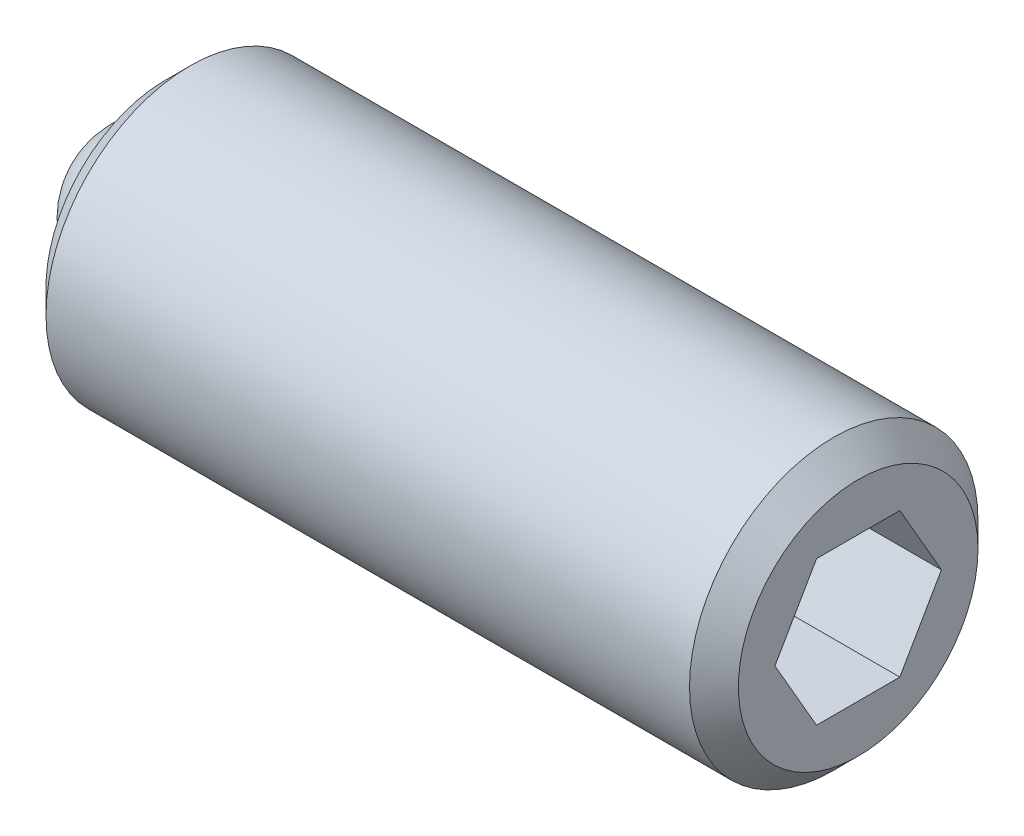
from build123d import *

# Parameters (mm, degrees)
SKETCH2_R           = 1.5
BOSS_EXTRUDE1_DEPTH = 7.2
CHAMFER1_SIZE       = 0.254
CHAMFER2_SIZE       = 0.254
CUT_EXTRUDE2_DEPTH  = 2
SKETCH3_R           = 0.8
CUT_EXTRUDE3_DEPTH  = 0.8
CUT_EXTRUDE4_DEPTH  = 0.8


with BuildPart() as part:
    # Sketch2 → Boss-Extrude1 (new body)
    with BuildSketch(Plane(origin=(0, 0, 0), x_dir=(0, 0, -1), z_dir=(1, 0, 0))):
        Circle(SKETCH2_R)
    extrude(amount=BOSS_EXTRUDE1_DEPTH)

    # Chamfer1
    chamfer1_edges = [part.edges().sort_by_distance(p)[0] for p in [
        (0, 0, 1.5),
    ]]
    chamfer(chamfer1_edges, length=CHAMFER1_SIZE)

    # Chamfer2
    chamfer2_edges = [part.edges().sort_by_distance(p)[0] for p in [
        (7.2, 0, 1.5),
    ]]
    chamfer(chamfer2_edges, length=CHAMFER2_SIZE)

    # Sketch4 → Cut-Extrude2 (cut)
    with BuildSketch(Plane(origin=(7.2, 0, 0), x_dir=(0, 0, -1), z_dir=(1, 0, 0))):
        Polygon((0.866025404, 0), (0.433012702, 0.75), (-0.433012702, 0.75), (-0.866025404, 0), (-0.433012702, -0.75), (0.433012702, -0.75), align=None)
    extrude(amount=-CUT_EXTRUDE2_DEPTH, mode=Mode.SUBTRACT)

    # Sketch3 → Cut-Extrude3 (cut)
    with BuildSketch(Plane.ZY):
        Circle(SKETCH3_R)
    extrude(amount=-CUT_EXTRUDE3_DEPTH, mode=Mode.SUBTRACT)

    # Sketch7 → Cut-Extrude4 (cut)
    with BuildSketch(Plane.ZY):
        with BuildLine():
            ThreePointArc((0.063449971, 0.797479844), (0, 0.8), (-0.063449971, 0.797479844))
            ThreePointArc((-0.063449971, 0.797479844), (0, 0.8635), (0.063449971, 0.797479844))
        make_face()
    extrude(amount=-CUT_EXTRUDE4_DEPTH, mode=Mode.SUBTRACT)


with BuildPart() as body_2:
    # Sketch5 → Revolve1 (revolve)
    with BuildSketch(Plane.ZY):
        with BuildLine():
            Line((0, 0), (0, -0.8))
            ThreePointArc((0, -0.8), (-0.8, 0), (0, 0.8))
            Line((0, 0.8), (0, 0))
        make_face()
    revolve(axis=Axis((0, 0, 0), (0, 1, 0)))


solid = Compound([part.part, body_2.part])
